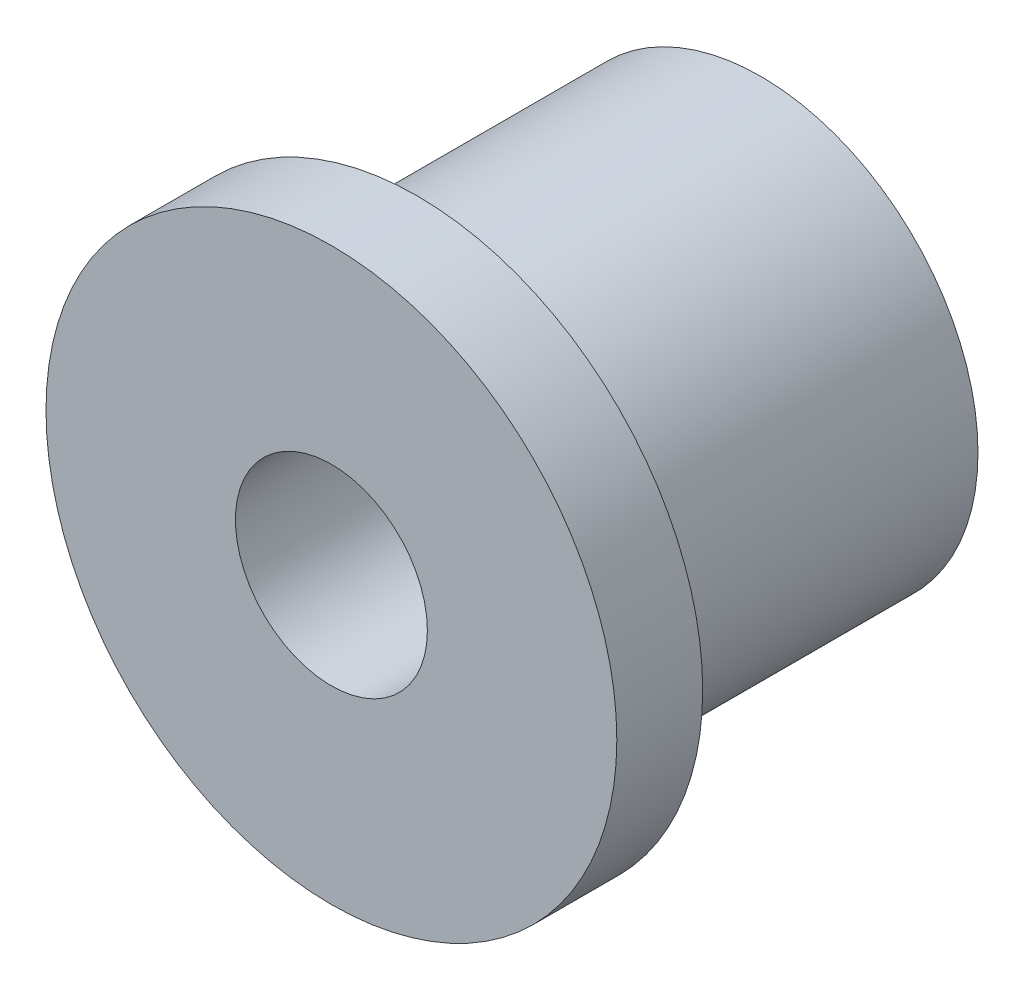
from build123d import *

# Parameters (mm, degrees)
SKETCH1_R           = 5.461
BASE_EXTRUDE_DEPTH  = 8.636
SKETCH5_R           = 7.1755
BOSS_EXTRUDE4_DEPTH = 2.159
SKETCH6_R           = 2.413
CUT_EXTRUDE1_DEPTH  = 7.874


with BuildPart() as part:
    # Sketch1 → Base-Extrude (new body)
    with BuildSketch(Plane.XY):
        Circle(SKETCH1_R)
    extrude(amount=BASE_EXTRUDE_DEPTH)

    # Sketch5 → Boss-Extrude4 (add)
    with BuildSketch(Plane.XY.offset(8.636)):
        Circle(SKETCH5_R)
    extrude(amount=BOSS_EXTRUDE4_DEPTH)

    # Sketch6 → Cut-Extrude1 (cut)
    with BuildSketch(Plane.XY.offset(10.795)):
        Circle(SKETCH6_R)
    extrude(amount=-CUT_EXTRUDE1_DEPTH, mode=Mode.SUBTRACT)


solid = part.part
